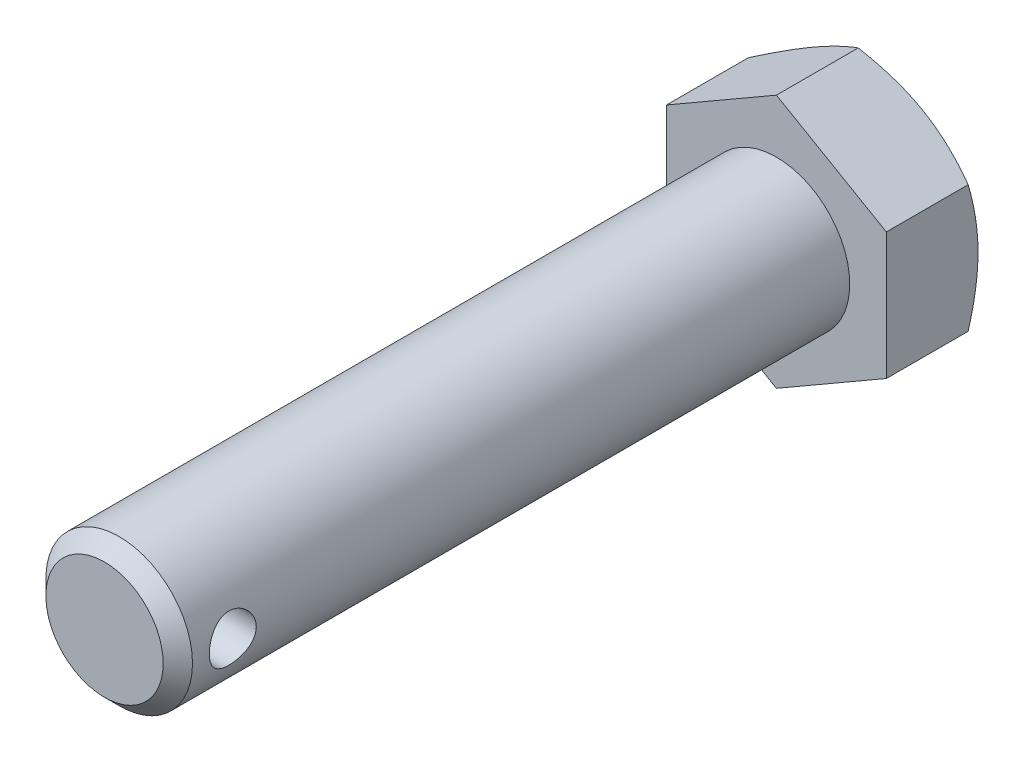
from build123d import *

# Parameters (mm, degrees)
ESQUISSE1_W                  = 6
ESQUISSE1_H                  = 55
CHANFREIN1_SIZE              = 1.2
BOSS_EXTRU_1_DEPTH           = 7.5
ENL_V_MAT_EXTRU_4_DEPTH      = 10
ENL_V_MAT_EXTRU_4_DEPTH_BACK = 10
ESQUISSE13_R                 = 1.921707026


with BuildPart() as part:
    # Esquisse1 → Base-R_volution (revolve)
    with BuildSketch(Plane(origin=(0, 0, 0), x_dir=(1, 0, 0), z_dir=(0, 1, 0))):
        with Locations((3, -27.5)):
            Rectangle(ESQUISSE1_W, ESQUISSE1_H)
    revolve(axis=Axis((0, 0, 0), (0, 0, 1)))

    # Chanfrein1
    chanfrein1_edges = [part.edges().sort_by_distance(p)[0] for p in [
        (-6, 0, 55),
    ]]
    chamfer(chanfrein1_edges, length=CHANFREIN1_SIZE)

    # Esquisse6 → Boss.-Extru.1 (add)
    with BuildSketch(Plane.XY):
        Polygon((9, -5.196152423), (9, 5.196152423), (0, 10.392304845), (-9, 5.196152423), (-9, -5.196152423), (0, -10.392304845), align=None)
    extrude(amount=-BOSS_EXTRU_1_DEPTH)

    # Esquisse7 → Enl_vement de mati_re-R_volution1 (revolve, cut)
    with BuildSketch(Plane(origin=(0, 0, 0), x_dir=(1, 0, 0), z_dir=(0, 1, 0))):
        Polygon((-9, 7.5), (-21.990381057, 7.5), (-21.990381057, 0), align=None)
    revolve(axis=Axis((0, 0, -6.239446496), (0, 0, 1)), mode=Mode.SUBTRACT)

    # Esquisse13 → Enl_v. mat.-Extru.4 (cut, two sides: drawn at the far end of the back side and taken through both)
    with BuildSketch(Plane(origin=(0, 0, 0), x_dir=(0, 0, -1), z_dir=(1, 0, 0)).offset(-ENL_V_MAT_EXTRU_4_DEPTH_BACK)):
        with Locations((-50.5, 0)):
            Circle(ESQUISSE13_R)
    extrude(amount=ENL_V_MAT_EXTRU_4_DEPTH + ENL_V_MAT_EXTRU_4_DEPTH_BACK, mode=Mode.SUBTRACT)


solid = part.part
